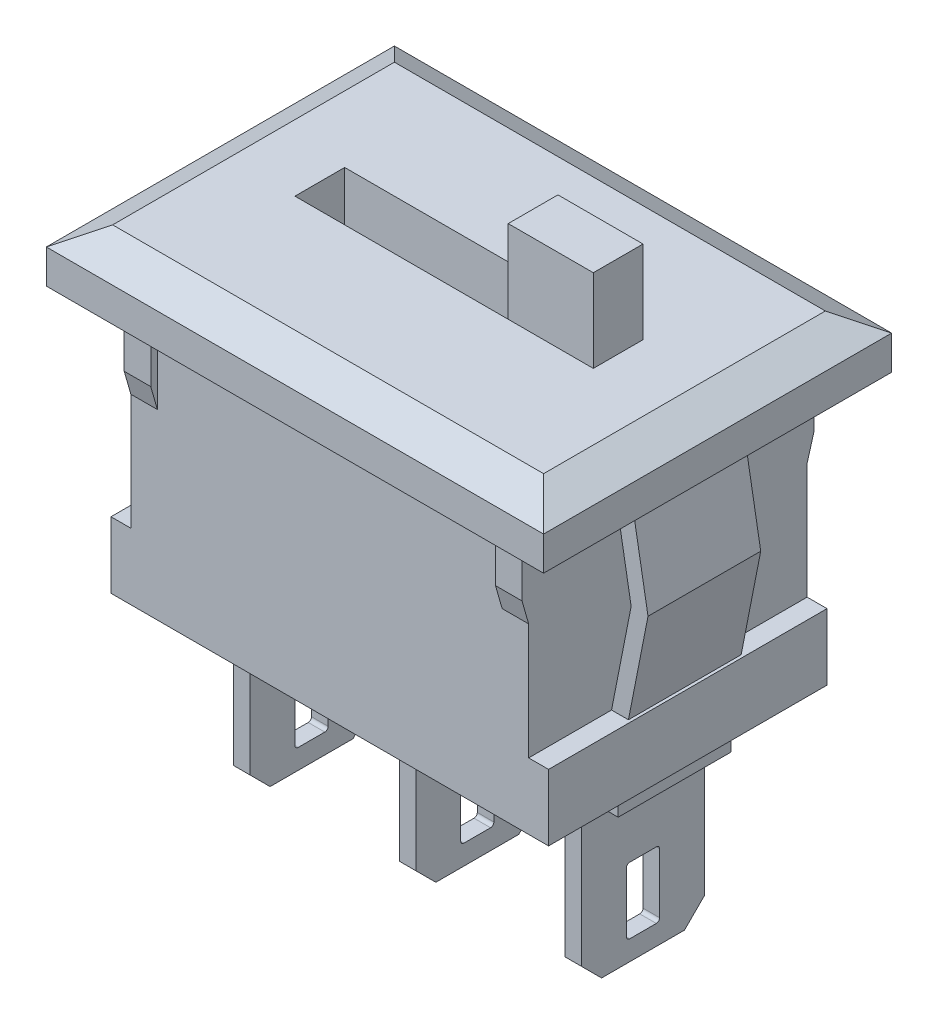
from build123d import *

# Parameters (mm, degrees)
SKETCH_1_W                 = 15
SKETCH_1_H                 = 10.5
EXTRUDE_1_DEPTH            = 1.6
CHAMFER_1_SIZE             = 1
CHAMFER_1_SIZE2            = 0.577350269
SKETCH_2_W                 = 10.3
SKETCH_2_H                 = 6.5
CUT_EXTRUDE_1_DEPTH        = 1.5
SKETCH_5_W                 = 12
SKETCH_5_H                 = 8.4
EXTRUDE_3_DEPTH            = 8.1
EXTRUDE_4_DEPTH            = 0.8
SKETCH_7_W                 = 8.4
SKETCH_7_H                 = 2
EXTRUDE_5_DEPTH            = 0.6
EXTRUDE_6_DEPTH            = 1.7
MIRROR_2_COPY_1_DEPTH      = 0.8
EXTRUDE_7_DEPTH            = 0.25
SKETCH_13_W                = 0.94
SKETCH_13_H                = 3.4
EXTRUDE_8_DEPTH            = 0.7
PATTERN_LINEAR_6_COUNT     = 2
PATTERN_LINEAR_6_PITCH     = 5
PATTERN_LINEAR_6_COL_COUNT = 2
PATTERN_LINEAR_6_COL_PITCH = 5
PATTERN_LINEAR_7_COUNT     = 2
PATTERN_LINEAR_7_PITCH     = 5
PATTERN_LINEAR_7_2_COUNT   = 2
PATTERN_LINEAR_7_2_PITCH   = 5
SKETCH2_W                  = 10.3
SKETCH2_H                  = 6.5
BOSS_EXTRUDE1_DEPTH        = 1.5
SKETCH3_W                  = 9
SKETCH3_H                  = 1.5
CUT_EXTRUDE2_DEPTH         = 1.5
SKETCH4_W                  = 2.567401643
SKETCH4_H                  = 1.5
BOSS_EXTRUDE2_DEPTH        = 4


with BuildPart() as part:
    # Sketch 1 → Extrude 1 (new body)
    with BuildSketch(Plane(origin=(0, 0, 0), x_dir=(1, 0, 0), z_dir=(0, 1, 0))):
        Rectangle(SKETCH_1_W, SKETCH_1_H)
    extrude(amount=EXTRUDE_1_DEPTH)

    # Chamfer 1
    chamfer_1_edges = [part.edges().sort_by_distance(p)[0] for p in [
        (-7.5, 1.6, 0),
        (0, 1.6, 5.25),
        (7.5, 1.6, 0),
        (0, 1.6, -5.25),
    ]]
    chamfer_1_side = [part.faces().sort_by_distance(p)[0] for p in [
        (0, 1.6, 0),
    ]]
    chamfer(chamfer_1_edges, length=CHAMFER_1_SIZE, length2=CHAMFER_1_SIZE2, reference=chamfer_1_side[0])

    # Sketch 2 → Cut-Extrude 1 (cut)
    with BuildSketch(Plane(origin=(0, 1.6, 0), x_dir=(1, 0, 0), z_dir=(0, 1, 0))):
        Rectangle(SKETCH_2_W, SKETCH_2_H)
    extrude(amount=-CUT_EXTRUDE_1_DEPTH, mode=Mode.SUBTRACT)

    # Sketch 5 → Extrude 3 (add)
    with BuildSketch(Plane.XZ):
        Rectangle(SKETCH_5_W, SKETCH_5_H)
    extrude(amount=EXTRUDE_3_DEPTH)

    # Sketch 6 → Extrude 4 (add)
    with BuildSketch(Plane.ZY.offset(6)):
        Polygon((4.4, 0), (4.4, -1.9), (4.2, -2.6), (4.2, 0), align=None)
    extrude_4 = extrude(amount=-EXTRUDE_4_DEPTH)

    # Sketch 7 → Extrude 5 (add)
    with BuildSketch(Plane.ZY.offset(6)):
        with Locations((0, -7.1)):
            Rectangle(SKETCH_7_W, SKETCH_7_H)
    extrude_5 = extrude(amount=EXTRUDE_5_DEPTH)

    # Mirror 1: Extrude 4 across plane
    add(extrude_4.mirror(Plane.XY))

    # Sketch 8 → Extrude 6 (add, symmetric)
    with BuildSketch(Plane.XY):
        Polygon((-6.05, 0), (-6.557595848, 0), (-7.1, -3.1), (-6.509590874, -6.1), (-6, -6.1), (-6.591465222, -3.094633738), align=None)
    extrude_6 = extrude(amount=EXTRUDE_6_DEPTH, both=True)

    # Mirror 2: Extrude 4, Extrude 5, Extrude 6 across plane
    add(extrude_4.mirror(Plane(origin=(0, 0, 0), x_dir=(0, 0, 1), z_dir=(1, 0, 0))))
    add(extrude_5.mirror(Plane(origin=(0, 0, 0), x_dir=(0, 0, 1), z_dir=(1, 0, 0))))
    add(extrude_6.mirror(Plane(origin=(0, 0, 0), x_dir=(0, 0, 1), z_dir=(1, 0, 0))))

    # Mirror 2 copy 1 sketch → Mirror 2 copy 1 (add)
    with BuildSketch(Plane(origin=(6, 0, 0), x_dir=(0, 0, -1), z_dir=(1, 0, 0))):
        Polygon((4.4, 0), (4.4, -1.9), (4.2, -2.6), (4.2, 0), align=None)
    extrude(amount=-MIRROR_2_COPY_1_DEPTH)

    # Sketch 13 → Extrude 8 (add)
    with BuildSketch(Plane.XZ.offset(8.1)):
        with Locations((-0.73, 0)):
            Rectangle(SKETCH_13_W, SKETCH_13_H)
        with Locations((0.73, 0)):
            Rectangle(SKETCH_13_W, SKETCH_13_H)
    extrude_8 = extrude(amount=EXTRUDE_8_DEPTH)

    # Pattern Linear 6: Extrude 8 ×2
    with Locations(*[(i * PATTERN_LINEAR_6_PITCH, 0, 0) for i in range(1, PATTERN_LINEAR_6_COUNT)]):
        add(extrude_8)

    # Pattern Linear 6 col: Extrude 8 ×2
    with Locations(*[(-i * PATTERN_LINEAR_6_COL_PITCH, 0, 0) for i in range(1, PATTERN_LINEAR_6_COL_COUNT)]):
        add(extrude_8)


with BuildPart() as body_2:
    # Sketch 12 → Extrude 7 (new, symmetric)
    with BuildSketch(Plane(origin=(0, 0, 0), x_dir=(0, 0, -1), z_dir=(1, 0, 0))):
        with BuildLine():
            Line((-2.63426029, -8.1), (-3.05, -8.722222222))
            Line((-3.05, -8.722222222), (-2.63426029, -9))
            Line((-2.63426029, -9), (-2.216295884, -8.374448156))
            ThreePointArc((-2.216295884, -8.374448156), (-1.991944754, -8.294170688), (-1.85, -8.485559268))
            Line((-1.85, -8.485559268), (-1.85, -13.1))
            Line((-1.85, -13.1), (-1.25, -13.7))
            Line((-1.25, -13.7), (0, -13.7))
            Line((0, -13.7), (0, -13.1))
            Line((0, -13.1), (-0.4, -13.1))
            ThreePointArc((-0.4, -13.1), (-0.470710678, -13.070710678), (-0.5, -13))
            Line((-0.5, -13), (-0.5, -11.2))
            ThreePointArc((-0.5, -11.2), (-0.470710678, -11.129289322), (-0.4, -11.1))
            Line((-0.4, -11.1), (0, -11.1))
            Line((0, -11.1), (0, -8.1))
            Line((0, -8.1), (-2.63426029, -8.1))
        make_face()
    extrude(amount=EXTRUDE_7_DEPTH, both=True)

    # Mirror 4: body 2 across plane


with BuildPart() as body_2_1:
    add(body_2.part)
    add(body_2.part.mirror(Plane(origin=(0.25, -11.1, 0), x_dir=(1, 0, 0), z_dir=(0, 0, 1))))


with BuildPart() as pattern_linear_7_1:
    # Pattern Linear 7: pattern copy
    add(body_2_1.part.moved(Location(Vector(-1, 0, 0) * (1 * PATTERN_LINEAR_7_PITCH))))


with BuildPart() as pattern_linear_7_2_1:
    # Pattern Linear 7 2: pattern copy
    add(body_2_1.part.moved(Location(Vector(1, 0, 0) * (1 * PATTERN_LINEAR_7_2_PITCH))))


with BuildPart() as body_2_2:
    add(body_2_1.part)

    # Combine 1: union part, Pattern Linear 7_1, Pattern Linear 7 2_1
    add(part.part)
    add(pattern_linear_7_1.part)
    add(pattern_linear_7_2_1.part)

    # Sketch2 → Boss-Extrude1 (add)
    with BuildSketch(Plane(origin=(0, 0.1, 0), x_dir=(1, 0, 0), z_dir=(0, 1, 0))):
        Rectangle(SKETCH2_W, SKETCH2_H)
    extrude(amount=BOSS_EXTRUDE1_DEPTH)

    # Sketch3 → Cut-Extrude2 (cut)
    with BuildSketch(Plane(origin=(0, 1.6, 0), x_dir=(1, 0, 0), z_dir=(0, 1, 0))):
        Rectangle(SKETCH3_W, SKETCH3_H)
    extrude(amount=-CUT_EXTRUDE2_DEPTH, mode=Mode.SUBTRACT)

    # Sketch4 → Boss-Extrude2 (add)
    with BuildSketch(Plane(origin=(0, 0.1, 0), x_dir=(1, 0, 0), z_dir=(0, 1, 0))):
        with Locations((3.216299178, 0)):
            Rectangle(SKETCH4_W, SKETCH4_H)
    extrude(amount=BOSS_EXTRUDE2_DEPTH)


solid = body_2_2.part
